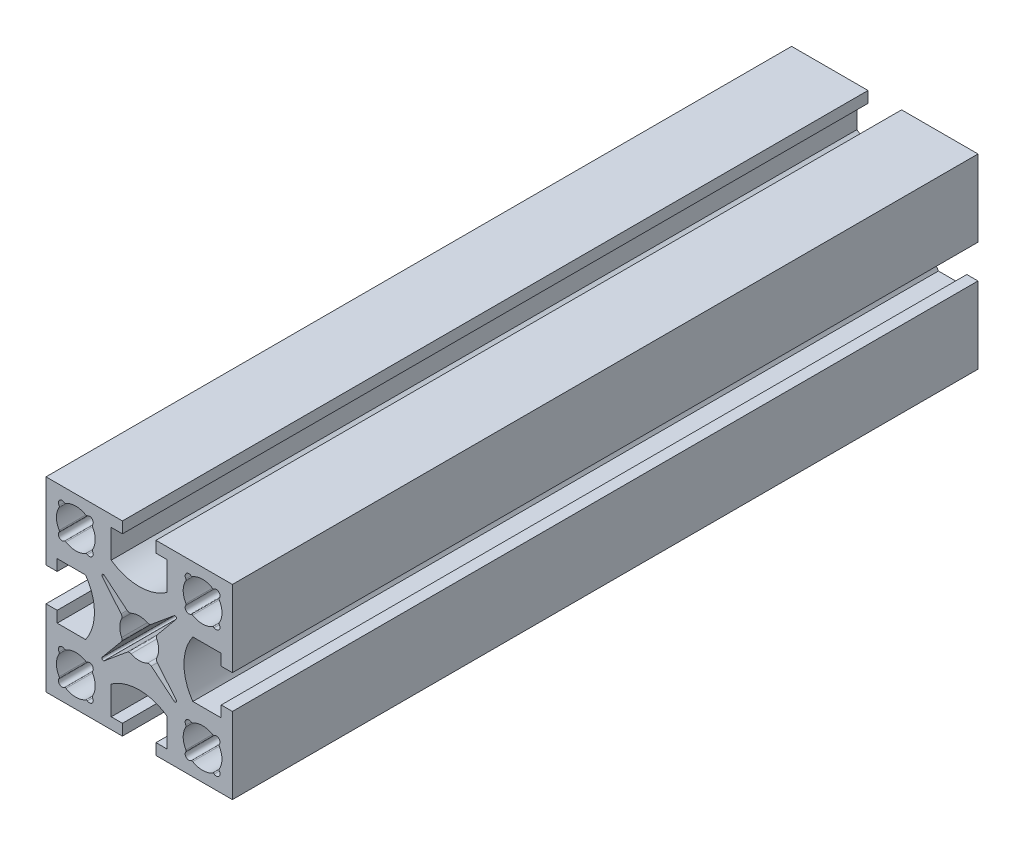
from build123d import *

# Parameters (mm, degrees)
EXTRUDE_1_DEPTH = 50


with BuildPart() as part:
    # Sketch 1 → Extrude 1 (new, symmetric)
    with BuildSketch(Plane.XY):
        with BuildLine():
            Line((-11, 3.75), (-7.190809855, 3.75))
            ThreePointArc((-7.190809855, 3.75), (-6, 0), (-7.190809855, -3.75))
            Line((-7.190809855, -3.75), (-11, -3.75))
            Line((-11, -3.75), (-11, -2.25))
            Line((-11, -2.25), (-12.5, -2.25))
            Line((-12.5, -2.25), (-12.5, -12.5))
            Line((-12.5, -12.5), (-2.25, -12.5))
            Line((-2.25, -12.5), (-2.25, -11))
            Line((-2.25, -11), (-3.75, -11))
            Line((-3.75, -11), (-3.75, -7.190809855))
            ThreePointArc((-3.75, -7.190809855), (0, -6), (3.75, -7.190809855))
            Line((3.75, -7.190809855), (3.75, -11))
            Line((3.75, -11), (2.25, -11))
            Line((2.25, -11), (2.25, -12.5))
            Line((2.25, -12.5), (12.5, -12.5))
            Line((12.5, -12.5), (12.5, -2.25))
            Line((12.5, -2.25), (11, -2.25))
            Line((11, -2.25), (11, -3.75))
            Line((11, -3.75), (7.190809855, -3.75))
            ThreePointArc((7.190809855, -3.75), (6, 0), (7.190809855, 3.75))
            Line((7.190809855, 3.75), (11, 3.75))
            Line((11, 3.75), (11, 2.25))
            Line((11, 2.25), (12.5, 2.25))
            Line((12.5, 2.25), (12.5, 12.5))
            Line((12.5, 12.5), (2.25, 12.5))
            Line((2.25, 12.5), (2.25, 11))
            Line((2.25, 11), (3.75, 11))
            Line((3.75, 11), (3.75, 7.190809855))
            ThreePointArc((3.75, 7.190809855), (0, 6), (-3.75, 7.190809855))
            Line((-3.75, 7.190809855), (-3.75, 11))
            Line((-3.75, 11), (-2.25, 11))
            Line((-2.25, 11), (-2.25, 12.5))
            Line((-2.25, 12.5), (-12.5, 12.5))
            Line((-12.5, 12.5), (-12.5, 2.25))
            Line((-12.5, 2.25), (-11, 2.25))
            Line((-11, 2.25), (-11, 3.75))
        make_face()
        with BuildLine():
            Line((-1.623138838, 2.427465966), (-4.680679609, 4.962294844))
            ThreePointArc((-4.680679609, 4.962294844), (-4.817642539, 5.008109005), (-4.949747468, 4.949747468))
            ThreePointArc((-4.949747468, 4.949747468), (-5.008109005, 4.817642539), (-4.962294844, 4.680679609))
            Line((-4.962294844, 4.680679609), (-2.427465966, 1.623138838))
            ThreePointArc((-2.427465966, 1.623138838), (-2.31654343, 1.368352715), (-2.35877686, 1.093696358))
            ThreePointArc((-2.35877686, 1.093696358), (-2.6, 0), (-2.35877686, -1.093696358))
            ThreePointArc((-2.35877686, -1.093696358), (-2.31654343, -1.368352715), (-2.427465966, -1.623138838))
            Line((-2.427465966, -1.623138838), (-4.962294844, -4.680679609))
            ThreePointArc((-4.962294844, -4.680679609), (-5.008109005, -4.817642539), (-4.949747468, -4.949747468))
            ThreePointArc((-4.949747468, -4.949747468), (-4.817642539, -5.008109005), (-4.680679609, -4.962294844))
            Line((-4.680679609, -4.962294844), (-1.623138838, -2.427465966))
            ThreePointArc((-1.623138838, -2.427465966), (-1.368352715, -2.31654343), (-1.093696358, -2.35877686))
            ThreePointArc((-1.093696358, -2.35877686), (0, -2.6), (1.093696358, -2.35877686))
            ThreePointArc((1.093696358, -2.35877686), (1.368352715, -2.31654343), (1.623138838, -2.427465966))
            Line((1.623138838, -2.427465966), (4.680679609, -4.962294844))
            ThreePointArc((4.680679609, -4.962294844), (4.817642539, -5.008109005), (4.949747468, -4.949747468))
            ThreePointArc((4.949747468, -4.949747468), (5.008109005, -4.817642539), (4.962294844, -4.680679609))
            Line((4.962294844, -4.680679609), (2.427465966, -1.623138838))
            ThreePointArc((2.427465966, -1.623138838), (2.31654343, -1.368352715), (2.35877686, -1.093696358))
            ThreePointArc((2.35877686, -1.093696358), (2.6, 0), (2.35877686, 1.093696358))
            ThreePointArc((2.35877686, 1.093696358), (2.31654343, 1.368352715), (2.427465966, 1.623138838))
            Line((2.427465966, 1.623138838), (4.962294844, 4.680679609))
            ThreePointArc((4.962294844, 4.680679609), (5.008109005, 4.817642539), (4.949747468, 4.949747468))
            ThreePointArc((4.949747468, 4.949747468), (4.817642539, 5.008109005), (4.680679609, 4.962294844))
            Line((4.680679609, 4.962294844), (1.623138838, 2.427465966))
            ThreePointArc((1.623138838, 2.427465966), (1.368352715, 2.31654343), (1.093696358, 2.35877686))
            ThreePointArc((1.093696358, 2.35877686), (0, 2.6), (-1.093696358, 2.35877686))
            ThreePointArc((-1.093696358, 2.35877686), (-1.368352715, 2.31654343), (-1.623138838, 2.427465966))
        make_face(mode=Mode.SUBTRACT)
        with BuildLine():
            ThreePointArc((-10.735198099, 9.828115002), (-11.1, 8.5), (-10.735198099, 7.171884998))
            ThreePointArc((-10.735198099, 7.171884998), (-10.707323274, 7.061078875), (-10.744662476, 6.953093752))
            ThreePointArc((-10.744662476, 6.953093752), (-10.692031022, 6.307968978), (-10.046906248, 6.255337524))
            ThreePointArc((-10.046906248, 6.255337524), (-9.938921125, 6.292676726), (-9.828115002, 6.264801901))
            ThreePointArc((-9.828115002, 6.264801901), (-8.5, 5.9), (-7.171884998, 6.264801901))
            ThreePointArc((-7.171884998, 6.264801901), (-7.061078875, 6.292676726), (-6.953093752, 6.255337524))
            ThreePointArc((-6.953093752, 6.255337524), (-6.307968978, 6.307968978), (-6.255337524, 6.953093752))
            ThreePointArc((-6.255337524, 6.953093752), (-6.292676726, 7.061078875), (-6.264801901, 7.171884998))
            ThreePointArc((-6.264801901, 7.171884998), (-5.9, 8.5), (-6.264801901, 9.828115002))
            ThreePointArc((-6.264801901, 9.828115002), (-6.292676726, 9.938921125), (-6.255337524, 10.046906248))
            ThreePointArc((-6.255337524, 10.046906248), (-6.307968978, 10.692031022), (-6.953093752, 10.744662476))
            ThreePointArc((-6.953093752, 10.744662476), (-7.061078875, 10.707323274), (-7.171884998, 10.735198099))
            ThreePointArc((-7.171884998, 10.735198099), (-8.5, 11.1), (-9.828115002, 10.735198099))
            ThreePointArc((-9.828115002, 10.735198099), (-9.938921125, 10.707323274), (-10.046906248, 10.744662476))
            ThreePointArc((-10.046906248, 10.744662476), (-10.692031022, 10.692031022), (-10.744662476, 10.046906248))
            ThreePointArc((-10.744662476, 10.046906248), (-10.707323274, 9.938921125), (-10.735198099, 9.828115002))
        make_face(mode=Mode.SUBTRACT)
        with BuildLine():
            ThreePointArc((10.744662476, 10.046906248), (10.707323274, 9.938921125), (10.735198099, 9.828115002))
            ThreePointArc((10.735198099, 9.828115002), (11.1, 8.5), (10.735198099, 7.171884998))
            ThreePointArc((10.735198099, 7.171884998), (10.707323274, 7.061078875), (10.744662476, 6.953093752))
            ThreePointArc((10.744662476, 6.953093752), (10.692031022, 6.307968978), (10.046906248, 6.255337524))
            ThreePointArc((10.046906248, 6.255337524), (9.938921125, 6.292676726), (9.828115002, 6.264801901))
            ThreePointArc((9.828115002, 6.264801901), (8.5, 5.9), (7.171884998, 6.264801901))
            ThreePointArc((7.171884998, 6.264801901), (7.061078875, 6.292676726), (6.953093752, 6.255337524))
            ThreePointArc((6.953093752, 6.255337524), (6.307968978, 6.307968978), (6.255337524, 6.953093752))
            ThreePointArc((6.255337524, 6.953093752), (6.292676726, 7.061078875), (6.264801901, 7.171884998))
            ThreePointArc((6.264801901, 7.171884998), (5.9, 8.5), (6.264801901, 9.828115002))
            ThreePointArc((6.264801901, 9.828115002), (6.292676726, 9.938921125), (6.255337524, 10.046906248))
            ThreePointArc((6.255337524, 10.046906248), (6.307968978, 10.692031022), (6.953093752, 10.744662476))
            ThreePointArc((6.953093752, 10.744662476), (7.061078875, 10.707323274), (7.171884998, 10.735198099))
            ThreePointArc((7.171884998, 10.735198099), (8.5, 11.1), (9.828115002, 10.735198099))
            ThreePointArc((9.828115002, 10.735198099), (9.938921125, 10.707323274), (10.046906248, 10.744662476))
            ThreePointArc((10.046906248, 10.744662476), (10.692031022, 10.692031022), (10.744662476, 10.046906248))
        make_face(mode=Mode.SUBTRACT)
        with BuildLine():
            ThreePointArc((-10.744662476, -10.046906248), (-10.707323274, -9.938921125), (-10.735198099, -9.828115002))
            ThreePointArc((-10.735198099, -9.828115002), (-11.1, -8.5), (-10.735198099, -7.171884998))
            ThreePointArc((-10.735198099, -7.171884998), (-10.707323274, -7.061078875), (-10.744662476, -6.953093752))
            ThreePointArc((-10.744662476, -6.953093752), (-10.692031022, -6.307968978), (-10.046906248, -6.255337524))
            ThreePointArc((-10.046906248, -6.255337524), (-9.938921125, -6.292676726), (-9.828115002, -6.264801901))
            ThreePointArc((-9.828115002, -6.264801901), (-8.5, -5.9), (-7.171884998, -6.264801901))
            ThreePointArc((-7.171884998, -6.264801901), (-7.061078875, -6.292676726), (-6.953093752, -6.255337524))
            ThreePointArc((-6.953093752, -6.255337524), (-6.307968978, -6.307968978), (-6.255337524, -6.953093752))
            ThreePointArc((-6.255337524, -6.953093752), (-6.292676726, -7.061078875), (-6.264801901, -7.171884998))
            ThreePointArc((-6.264801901, -7.171884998), (-5.9, -8.5), (-6.264801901, -9.828115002))
            ThreePointArc((-6.264801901, -9.828115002), (-6.292676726, -9.938921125), (-6.255337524, -10.046906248))
            ThreePointArc((-6.255337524, -10.046906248), (-6.307968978, -10.692031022), (-6.953093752, -10.744662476))
            ThreePointArc((-6.953093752, -10.744662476), (-7.061078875, -10.707323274), (-7.171884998, -10.735198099))
            ThreePointArc((-7.171884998, -10.735198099), (-8.5, -11.1), (-9.828115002, -10.735198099))
            ThreePointArc((-9.828115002, -10.735198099), (-9.938921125, -10.707323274), (-10.046906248, -10.744662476))
            ThreePointArc((-10.046906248, -10.744662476), (-10.692031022, -10.692031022), (-10.744662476, -10.046906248))
        make_face(mode=Mode.SUBTRACT)
        with BuildLine():
            ThreePointArc((10.735198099, -9.828115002), (11.1, -8.5), (10.735198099, -7.171884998))
            ThreePointArc((10.735198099, -7.171884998), (10.707323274, -7.061078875), (10.744662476, -6.953093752))
            ThreePointArc((10.744662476, -6.953093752), (10.692031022, -6.307968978), (10.046906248, -6.255337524))
            ThreePointArc((10.046906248, -6.255337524), (9.938921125, -6.292676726), (9.828115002, -6.264801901))
            ThreePointArc((9.828115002, -6.264801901), (8.5, -5.9), (7.171884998, -6.264801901))
            ThreePointArc((7.171884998, -6.264801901), (7.061078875, -6.292676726), (6.953093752, -6.255337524))
            ThreePointArc((6.953093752, -6.255337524), (6.307968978, -6.307968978), (6.255337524, -6.953093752))
            ThreePointArc((6.255337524, -6.953093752), (6.292676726, -7.061078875), (6.264801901, -7.171884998))
            ThreePointArc((6.264801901, -7.171884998), (5.9, -8.5), (6.264801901, -9.828115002))
            ThreePointArc((6.264801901, -9.828115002), (6.292676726, -9.938921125), (6.255337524, -10.046906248))
            ThreePointArc((6.255337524, -10.046906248), (6.307968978, -10.692031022), (6.953093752, -10.744662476))
            ThreePointArc((6.953093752, -10.744662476), (7.061078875, -10.707323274), (7.171884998, -10.735198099))
            ThreePointArc((7.171884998, -10.735198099), (8.5, -11.1), (9.828115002, -10.735198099))
            ThreePointArc((9.828115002, -10.735198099), (9.938921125, -10.707323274), (10.046906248, -10.744662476))
            ThreePointArc((10.046906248, -10.744662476), (10.692031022, -10.692031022), (10.744662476, -10.046906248))
            ThreePointArc((10.744662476, -10.046906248), (10.707323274, -9.938921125), (10.735198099, -9.828115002))
        make_face(mode=Mode.SUBTRACT)
    extrude(amount=EXTRUDE_1_DEPTH, both=True)


solid = part.part
